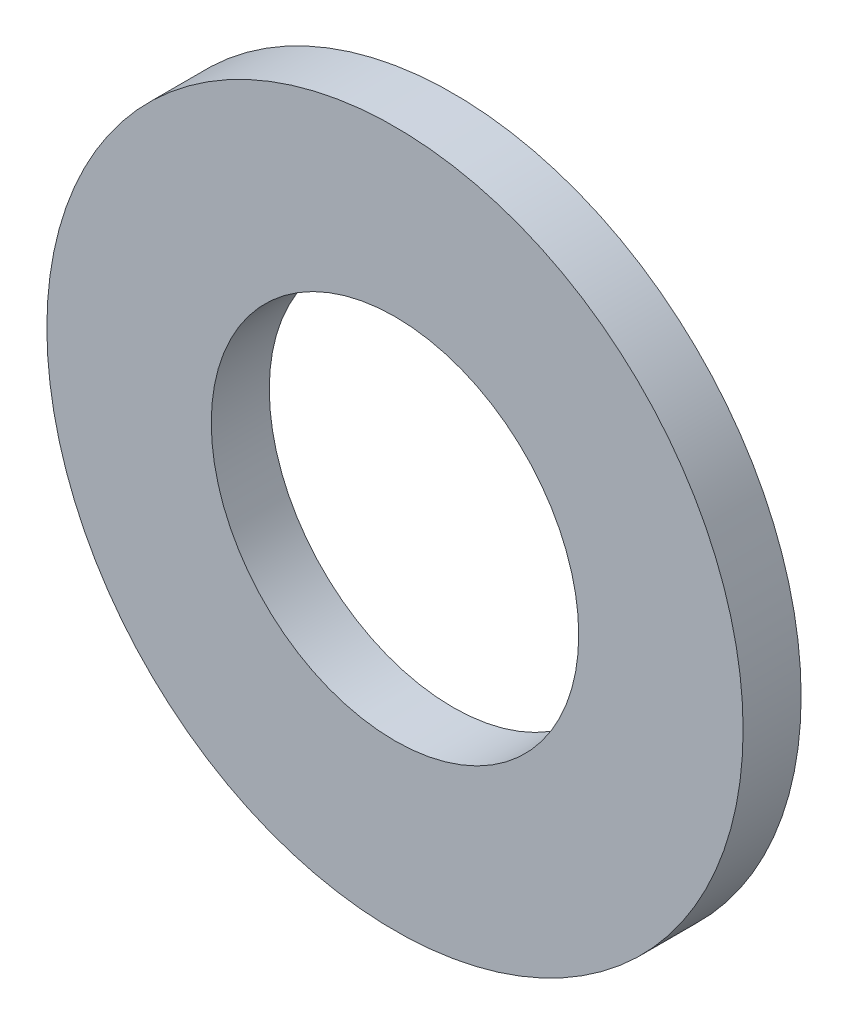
from build123d import *

# Parameters (mm, degrees)
E_CORPS_R              = 18
CORPS_DEPTH            = 3
E_PER_AGE_R            = 9.5
DIAM_TRE_NOMINAL_DEPTH = 26.632011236


with BuildPart() as part:
    # E_corps → Corps (new body)
    with BuildSketch(Plane.XY):
        Circle(E_CORPS_R)
    extrude(amount=CORPS_DEPTH)

    # E_per_age → Diam_tre_nominal (cut, through all)
    with BuildSketch(Plane(origin=(0, 0, 0), x_dir=(-1, 0, 0), z_dir=(0, 0, -1))):
        Circle(E_PER_AGE_R)
    extrude(amount=-DIAM_TRE_NOMINAL_DEPTH, mode=Mode.SUBTRACT)


solid = part.part
